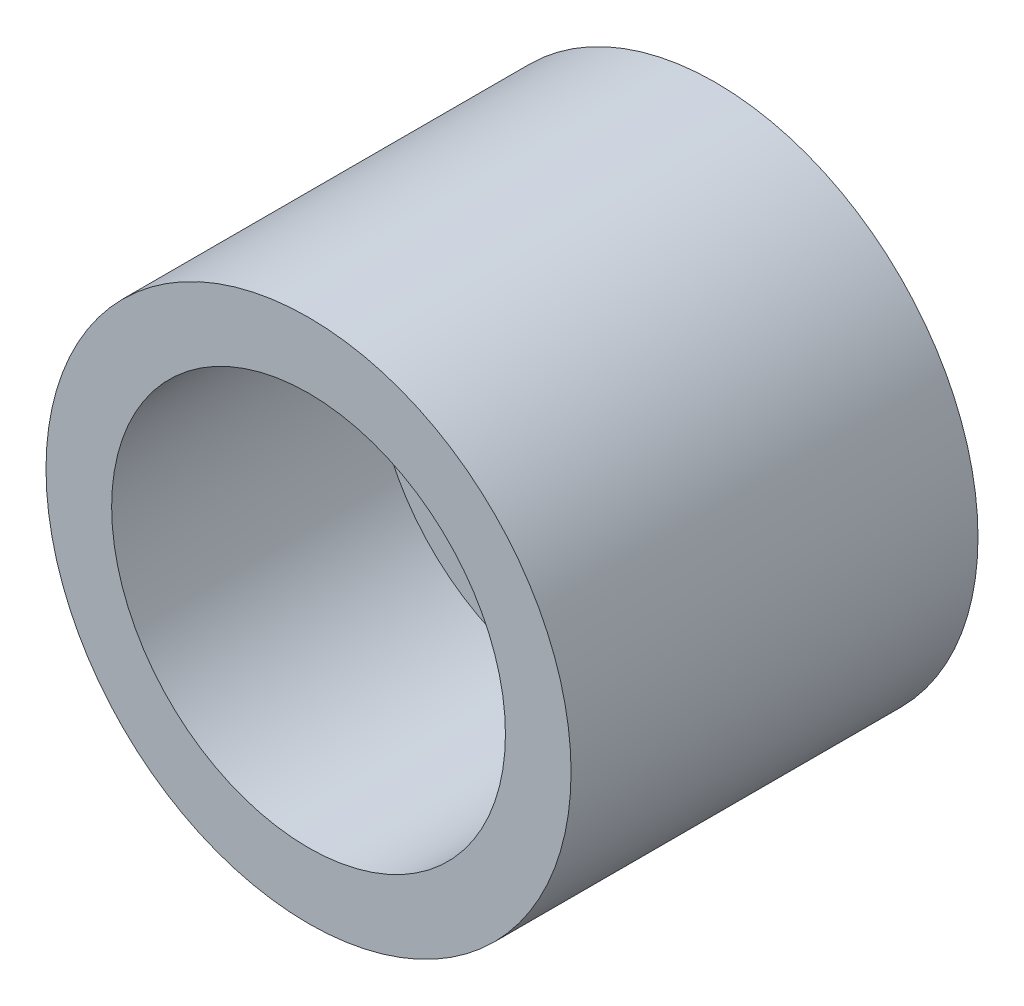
ISO-10303-21;
HEADER;
FILE_DESCRIPTION(('STEP AP214'),'2;1');
FILE_NAME('part.step','',(''),(''),'','','');
FILE_SCHEMA(('AUTOMOTIVE_DESIGN { 1 0 10303 214 1 1 1 1 }'));
ENDSEC;
DATA;
#1=APPLICATION_CONTEXT('core data for automotive mechanical design processes');
#2=APPLICATION_PROTOCOL_DEFINITION('international standard','automotive_design',2000,#1);
#3=PRODUCT_CONTEXT('',#1,'mechanical');
#4=PRODUCT('Part','Part','',(#3));
#5=PRODUCT_RELATED_PRODUCT_CATEGORY('part','',(#4));
#6=PRODUCT_DEFINITION_FORMATION('','',#4);
#7=PRODUCT_DEFINITION_CONTEXT('part definition',#1,'design');
#8=PRODUCT_DEFINITION('design','',#6,#7);
#9=PRODUCT_DEFINITION_SHAPE('','',#8);
#10=(LENGTH_UNIT() NAMED_UNIT(*) SI_UNIT(.MILLI.,.METRE.));
#11=(NAMED_UNIT(*) PLANE_ANGLE_UNIT() SI_UNIT($,.RADIAN.));
#12=(NAMED_UNIT(*) SI_UNIT($,.STERADIAN.) SOLID_ANGLE_UNIT());
#13=UNCERTAINTY_MEASURE_WITH_UNIT(LENGTH_MEASURE(1.E-05),#10,'distance_accuracy_value','');
#14=(GEOMETRIC_REPRESENTATION_CONTEXT(3) GLOBAL_UNCERTAINTY_ASSIGNED_CONTEXT((#13)) GLOBAL_UNIT_ASSIGNED_CONTEXT((#10,
#11,#12)) REPRESENTATION_CONTEXT('',''));
#15=CARTESIAN_POINT('',(0.,0.,0.));
#16=DIRECTION('',(0.,0.,1.));
#17=DIRECTION('',(1.,0.,0.));
#18=AXIS2_PLACEMENT_3D('',#15,#16,#17);
#19=CARTESIAN_POINT('',(0.,0.,15.5));
#20=DIRECTION('',(0.,0.,-1.));
#21=DIRECTION('',(-1.,0.,0.));
#22=AXIS2_PLACEMENT_3D('',#19,#20,#21);
#23=CYLINDRICAL_SURFACE('',#22,10.);
#24=CARTESIAN_POINT('',(0.,0.,15.5));
#25=DIRECTION('',(0.,0.,1.));
#26=DIRECTION('',(1.,0.,0.));
#27=AXIS2_PLACEMENT_3D('',#24,#25,#26);
#28=CIRCLE('',#27,10.);
#29=CARTESIAN_POINT('',(10.,0.,15.5));
#30=VERTEX_POINT('',#29);
#31=EDGE_CURVE('E10',#30,#30,#28,.T.);
#32=ORIENTED_EDGE('',*,*,#31,.F.);
#33=EDGE_LOOP('',(#32));
#34=FACE_BOUND('',#33,.T.);
#35=CARTESIAN_POINT('',(0.,0.,0.));
#36=DIRECTION('',(0.,0.,1.));
#37=DIRECTION('',(1.,0.,0.));
#38=AXIS2_PLACEMENT_3D('',#35,#36,#37);
#39=CIRCLE('',#38,10.);
#40=CARTESIAN_POINT('',(10.,0.,0.));
#41=VERTEX_POINT('',#40);
#42=EDGE_CURVE('E35',#41,#41,#39,.T.);
#43=ORIENTED_EDGE('',*,*,#42,.T.);
#44=EDGE_LOOP('',(#43));
#45=FACE_BOUND('',#44,.T.);
#46=ADVANCED_FACE('F29',(#34,#45),#23,.T.);
#47=CARTESIAN_POINT('',(0.,0.,15.5));
#48=DIRECTION('',(0.,0.,1.));
#49=DIRECTION('',(1.,0.,0.));
#50=AXIS2_PLACEMENT_3D('',#47,#48,#49);
#51=PLANE('',#50);
#52=CARTESIAN_POINT('',(0.,0.,15.5));
#53=DIRECTION('',(0.,0.,1.));
#54=DIRECTION('',(1.,0.,0.));
#55=AXIS2_PLACEMENT_3D('',#52,#53,#54);
#56=CIRCLE('',#55,7.5);
#57=CARTESIAN_POINT('',(7.5,0.,15.5));
#58=VERTEX_POINT('',#57);
#59=EDGE_CURVE('E39',#58,#58,#56,.T.);
#60=ORIENTED_EDGE('',*,*,#59,.F.);
#61=EDGE_LOOP('',(#60));
#62=FACE_BOUND('',#61,.T.);
#63=ORIENTED_EDGE('',*,*,#31,.T.);
#64=EDGE_LOOP('',(#63));
#65=FACE_BOUND('',#64,.T.);
#66=ADVANCED_FACE('F76',(#62,#65),#51,.T.);
#67=CARTESIAN_POINT('',(0.,0.,0.));
#68=DIRECTION('',(0.,0.,1.));
#69=DIRECTION('',(1.,0.,0.));
#70=AXIS2_PLACEMENT_3D('',#67,#68,#69);
#71=PLANE('',#70);
#72=CARTESIAN_POINT('',(0.,0.,0.));
#73=DIRECTION('',(0.,0.,1.));
#74=DIRECTION('',(1.,0.,0.));
#75=AXIS2_PLACEMENT_3D('',#72,#73,#74);
#76=CIRCLE('',#75,4.5);
#77=CARTESIAN_POINT('',(4.5,0.,0.));
#78=VERTEX_POINT('',#77);
#79=EDGE_CURVE('E51',#78,#78,#76,.T.);
#80=ORIENTED_EDGE('',*,*,#79,.T.);
#81=EDGE_LOOP('',(#80));
#82=FACE_BOUND('',#81,.T.);
#83=ORIENTED_EDGE('',*,*,#42,.F.);
#84=EDGE_LOOP('',(#83));
#85=FACE_BOUND('',#84,.T.);
#86=ADVANCED_FACE('F55',(#82,#85),#71,.F.);
#87=CARTESIAN_POINT('',(0.,0.,15.5));
#88=DIRECTION('',(0.,0.,1.));
#89=DIRECTION('',(1.,0.,0.));
#90=AXIS2_PLACEMENT_3D('',#87,#88,#89);
#91=CYLINDRICAL_SURFACE('',#90,7.5);
#92=CARTESIAN_POINT('',(0.,0.,5.5));
#93=DIRECTION('',(0.,0.,1.));
#94=DIRECTION('',(1.,0.,0.));
#95=AXIS2_PLACEMENT_3D('',#92,#93,#94);
#96=CIRCLE('',#95,7.5);
#97=CARTESIAN_POINT('',(7.5,0.,5.5));
#98=VERTEX_POINT('',#97);
#99=EDGE_CURVE('E43',#98,#98,#96,.T.);
#100=ORIENTED_EDGE('',*,*,#99,.F.);
#101=EDGE_LOOP('',(#100));
#102=FACE_BOUND('',#101,.T.);
#103=ORIENTED_EDGE('',*,*,#59,.T.);
#104=EDGE_LOOP('',(#103));
#105=FACE_BOUND('',#104,.T.);
#106=ADVANCED_FACE('F67',(#102,#105),#91,.F.);
#107=CARTESIAN_POINT('',(4.5,0.,5.5));
#108=DIRECTION('',(0.,0.,-1.));
#109=DIRECTION('',(-1.,0.,0.));
#110=AXIS2_PLACEMENT_3D('',#107,#108,#109);
#111=PLANE('',#110);
#112=CARTESIAN_POINT('',(0.,0.,5.5));
#113=DIRECTION('',(0.,0.,1.));
#114=DIRECTION('',(1.,0.,0.));
#115=AXIS2_PLACEMENT_3D('',#112,#113,#114);
#116=CIRCLE('',#115,4.5);
#117=CARTESIAN_POINT('',(4.5,0.,5.5));
#118=VERTEX_POINT('',#117);
#119=EDGE_CURVE('E48',#118,#118,#116,.T.);
#120=ORIENTED_EDGE('',*,*,#119,.F.);
#121=EDGE_LOOP('',(#120));
#122=FACE_BOUND('',#121,.T.);
#123=ORIENTED_EDGE('',*,*,#99,.T.);
#124=EDGE_LOOP('',(#123));
#125=FACE_BOUND('',#124,.T.);
#126=ADVANCED_FACE('F61',(#122,#125),#111,.F.);
#127=CARTESIAN_POINT('',(0.,0.,15.5));
#128=DIRECTION('',(0.,0.,1.));
#129=DIRECTION('',(1.,0.,0.));
#130=AXIS2_PLACEMENT_3D('',#127,#128,#129);
#131=CYLINDRICAL_SURFACE('',#130,4.5);
#132=ORIENTED_EDGE('',*,*,#79,.F.);
#133=EDGE_LOOP('',(#132));
#134=FACE_BOUND('',#133,.T.);
#135=ORIENTED_EDGE('',*,*,#119,.T.);
#136=EDGE_LOOP('',(#135));
#137=FACE_BOUND('',#136,.T.);
#138=ADVANCED_FACE('F58',(#134,#137),#131,.F.);
#139=CLOSED_SHELL('',(#46,#66,#86,#106,#126,#138));
#140=MANIFOLD_SOLID_BREP('B2',#139);
#141=ADVANCED_BREP_SHAPE_REPRESENTATION('',(#18,#140),#14);
#142=SHAPE_DEFINITION_REPRESENTATION(#9,#141);
ENDSEC;
END-ISO-10303-21;
